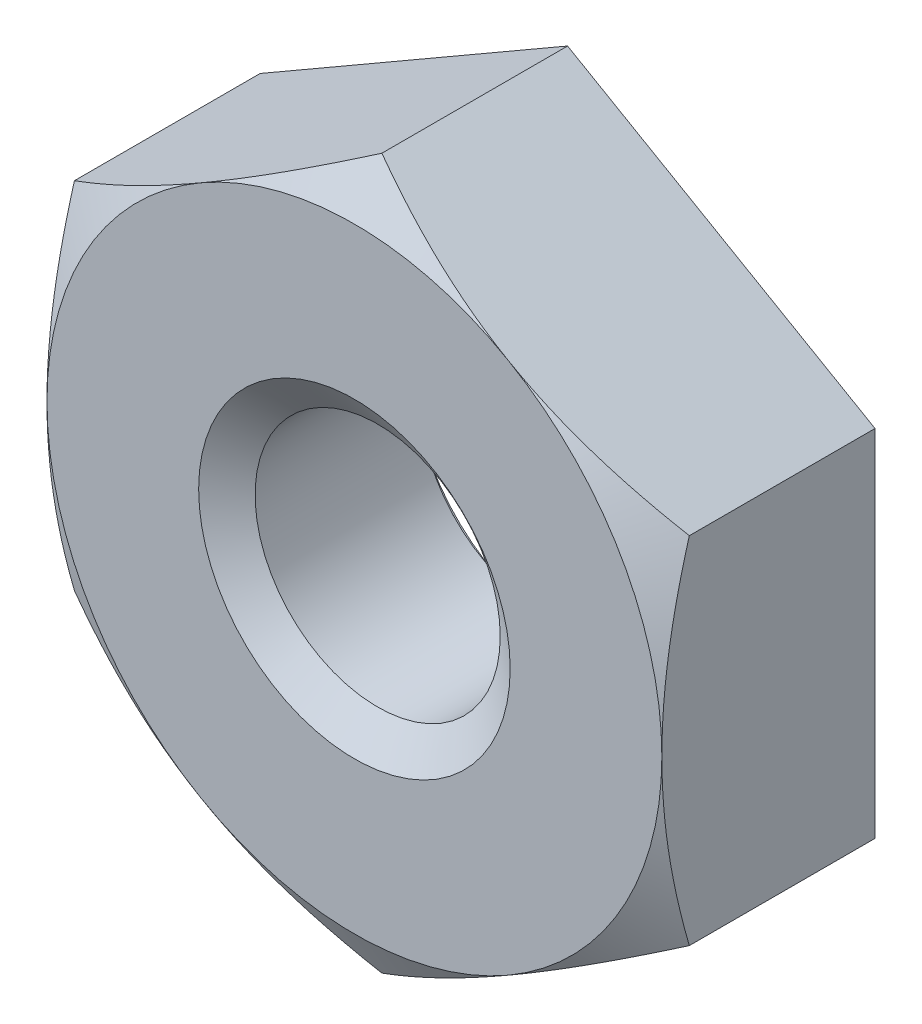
from build123d import *

# Parameters (mm, degrees)
BASENUT_START = -3.302
BASENUTSKE_R  = 1.89865
BASENUT_DEPTH = 3.302


with BuildPart() as part:
    # BaseNutSke → BaseNut (new body)
    with BuildSketch(Plane.XY.offset(BASENUT_START)):
        Polygon((4.7625, 2.749630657), (4.7625, -2.749630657), (0, -5.499261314), (-4.7625, -2.749630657), (-4.7625, 2.749630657), (0, 5.499261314), align=None)
        Circle(BASENUTSKE_R, mode=Mode.SUBTRACT)
    extrude(amount=BASENUT_DEPTH)

    # Sketch4 → Single-Chamfer (revolve, cut)
    with BuildSketch(Plane(origin=(0, 0, 0), x_dir=(0, 0, -1), z_dir=(1, 0, 0))):
        Polygon((0, 4.7625), (-12.7, 4.7625), (-12.7, 18.199261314), (0.425369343, 18.199261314), (0.425369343, 5.499261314), align=None)
    revolve(axis=Axis((0, 0, 0), (0, 0, -1)), mode=Mode.SUBTRACT)

    # EndChamferSketch → EndChamfer (revolve, cut)
    with BuildSketch(Plane(origin=(0, 0, 0), x_dir=(0, 0, -1), z_dir=(1, 0, 0)), mode=Mode.PRIVATE) as endchamfer_sk:
        Polygon((3.2766, 2.413), (2.880433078, 1.847215), (3.3274, 1.847215), (3.3274, 2.413), align=None)
        Polygon((-0.0508, 2.413), (0, 2.413), (0.396166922, 1.847215), (-0.0508, 1.847215), align=None)
    revolve(endchamfer_sk.sketch.rotate(Axis((0, 0, -25.037505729), (0, 0, -1)), 90), axis=Axis((0, 0, -25.037505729), (0, 0, -1)), mode=Mode.SUBTRACT)


solid = part.part
